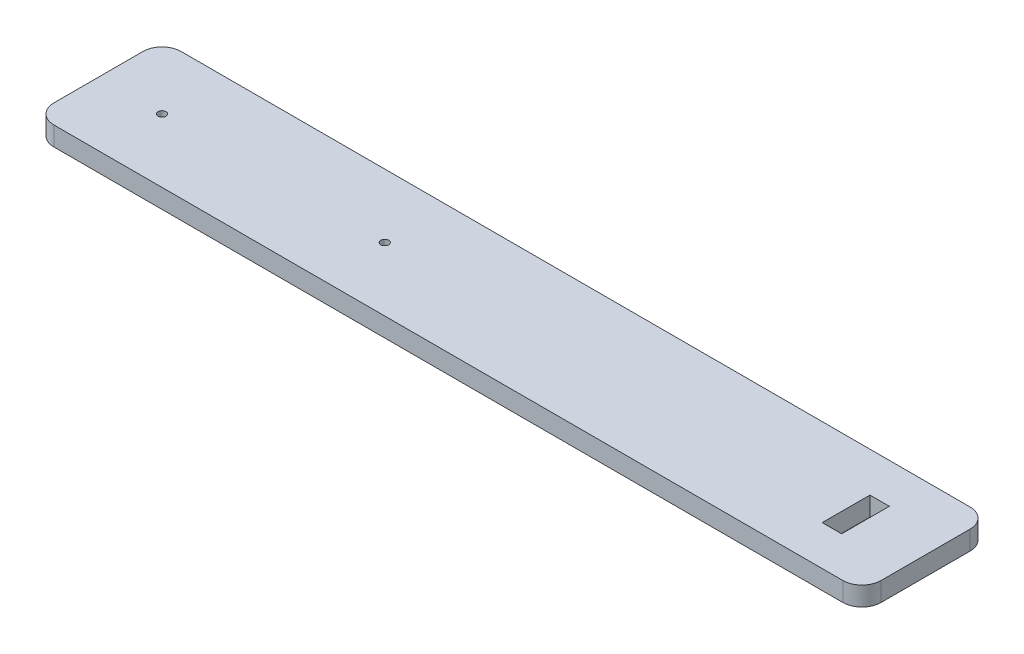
from build123d import *

# Parameters (mm, degrees)
IZIM1_W                     = 260
IZIM1_H                     = 40
IZIM1_R                     = 1.25
IZIM1_W_2                   = 6.1
IZIM1_H_2                   = 15
Y_KSEKLIK_EKSTR_ZYON1_DEPTH = 6
RADYUS1_R                   = 6


with BuildPart() as part:
    # izim1 → Y_kseklik-Ekstr_zyon1 (new body)
    with BuildSketch(Plane(origin=(0, 0, 0), x_dir=(1, 0, 0), z_dir=(0, 1, 0))):
        Rectangle(IZIM1_W, IZIM1_H)
        with Locations(Location((-110, 0, 0), (0, 0, 270))):
            Circle(IZIM1_R, mode=Mode.SUBTRACT)
        with Locations(Location((-40, 0, 0), (0, 0, 270))):
            Circle(IZIM1_R, mode=Mode.SUBTRACT)
        with Locations((108.05, 0)):
            Rectangle(IZIM1_W_2, IZIM1_H_2, mode=Mode.SUBTRACT)
    extrude(amount=Y_KSEKLIK_EKSTR_ZYON1_DEPTH)

    # Radyus1
    radyus1_edges = [part.edges().sort_by_distance(p)[0] for p in [
        (130, 3, 20),
        (-130, 3, 20),
        (-130, 3, -20),
        (130, 3, -20),
    ]]
    fillet(radyus1_edges, radius=RADYUS1_R)


solid = part.part
